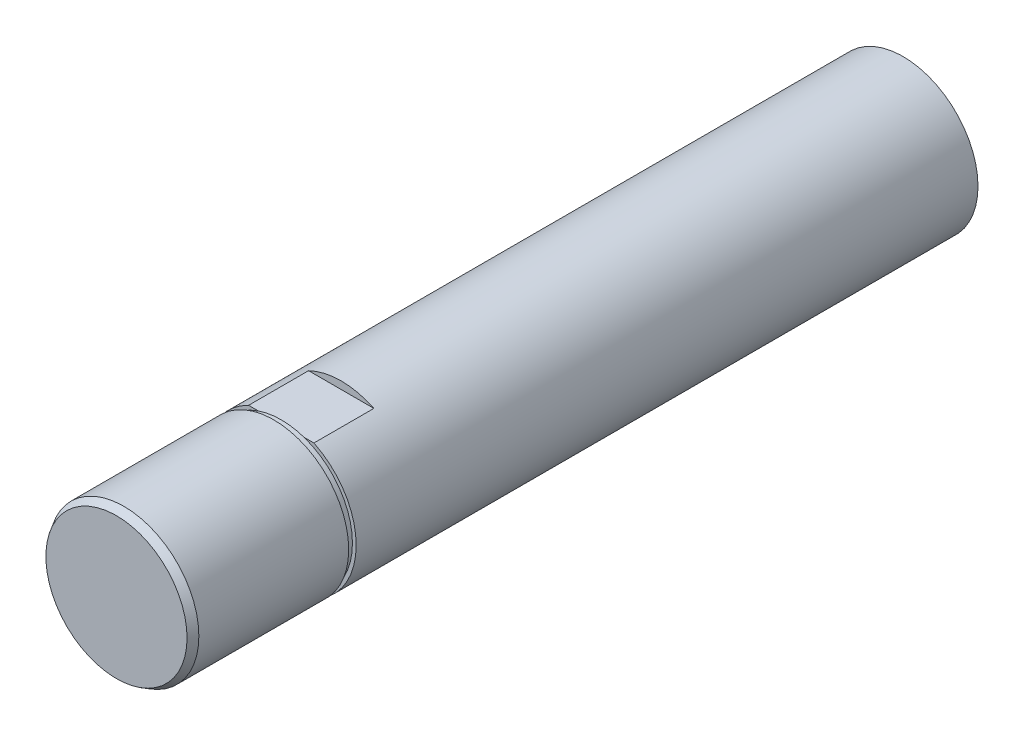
from build123d import *

# Parameters (mm, degrees)
SKETCH1_R        = 10
STROKE_DEPTH     = 75
EXTRUDE_START    = 11
SKETCH2_R        = 10
EXTRUDE_L2_DEPTH = 11
EXTRUDE_START_2  = 22
SKETCH3_R        = 10
EXTRUDE_L3_DEPTH = 22
CHAMFER2_SIZE    = 1
CHAMFER2_SIZE2   = 0.577350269
U_C_START        = 1
SKETCH5_R        = 10
SKETCH5_R_2      = 9.5
U_C_DEPTH        = 1
SKETCH6_W        = 8
SKETCH6_H        = 1.5
A_F_DEPTH        = 10.5


with BuildPart() as part:
    # Sketch1 → STROKE (new body)
    with BuildSketch(Plane.XY):
        Circle(SKETCH1_R)
    extrude(amount=-STROKE_DEPTH)

    # Sketch2 → Extrude L2 (add)
    with BuildSketch(Plane.XY.offset(EXTRUDE_START)):
        Circle(SKETCH2_R)
    extrude(amount=-EXTRUDE_L2_DEPTH)

    # Sketch3 → Extrude L3 (add)
    with BuildSketch(Plane.XY.offset(8).offset(EXTRUDE_START_2)):
        Circle(SKETCH3_R)
    extrude(amount=-EXTRUDE_L3_DEPTH)

    # Chamfer2
    chamfer2_edges = [part.edges().sort_by_distance(p)[0] for p in [
        (-10, 0, 30),
    ]]
    chamfer2_side = [part.faces().sort_by_distance(p)[0] for p in [
        (-10, 0, -22.5),
    ]]
    chamfer(chamfer2_edges, length=CHAMFER2_SIZE, length2=CHAMFER2_SIZE2, reference=chamfer2_side[0])

    # Sketch5 → U_C (cut)
    with BuildSketch(Plane.XY.offset(8).offset(U_C_START)):
        Circle(SKETCH5_R)
        Circle(SKETCH5_R_2, mode=Mode.SUBTRACT)
    extrude(amount=-U_C_DEPTH, mode=Mode.SUBTRACT)

    # Sketch6 → A_F (cut, symmetric)
    with BuildSketch(Plane(origin=(0, 0, 0), x_dir=(0, 0, -1), z_dir=(1, 0, 0))):
        with Locations((-4, 9.75)):
            Rectangle(SKETCH6_W, SKETCH6_H)
        with Locations((-4, -9.75)):
            Rectangle(SKETCH6_W, SKETCH6_H)
    extrude(amount=A_F_DEPTH, both=True, mode=Mode.SUBTRACT)


solid = part.part
